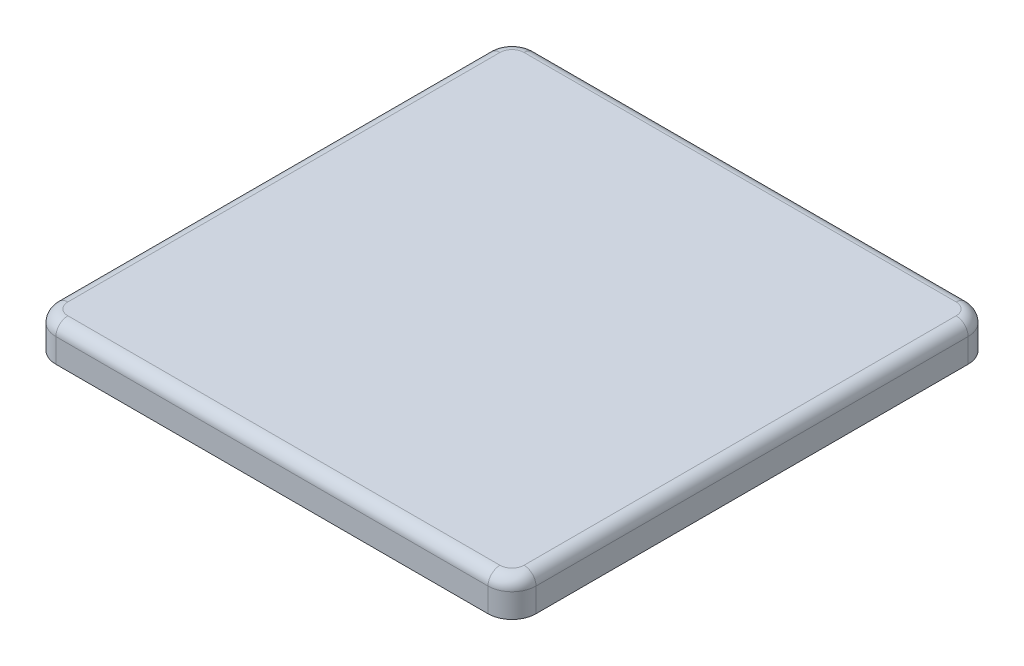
from build123d import *

# Parameters (mm, degrees)
EXTRUDE_1_DEPTH     = 1.5
FILLET_1_R          = 1
CUT_EXTRUDE_2_DEPTH = 1
SKETCH_4_W          = 2.7
SKETCH_4_H          = 4.2
EXTRUDE_4_DEPTH     = 7
FILLET_2_R          = 1


with BuildPart() as part:
    # Sketch 1 → Extrude 1 (new, symmetric)
    with BuildSketch(Plane(origin=(0, 0, 0), x_dir=(0, 0, -1), z_dir=(0, 1, 0))):
        with BuildLine():
            Line((-18, 20), (18, 20))
            ThreePointArc((18, 20), (19.414213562, 19.414213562), (20, 18))
            Line((20, 18), (20, -18))
            ThreePointArc((20, -18), (19.414213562, -19.414213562), (18, -20))
            Line((18, -20), (-18, -20))
            ThreePointArc((-18, -20), (-19.414213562, -19.414213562), (-20, -18))
            Line((-20, -18), (-20, 18))
            ThreePointArc((-20, 18), (-19.414213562, 19.414213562), (-18, 20))
        make_face()
    extrude(amount=EXTRUDE_1_DEPTH, both=True)

    # Fillet 1
    fillet_1_edges = [part.edges().sort_by_distance(p)[0] for p in [
        (-19.414213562, 1.5, 19.414213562),
        (0, 1.5, 20),
        (19.414213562, 1.5, 19.414213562),
        (20, 1.5, 0),
        (19.414213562, 1.5, -19.414213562),
        (0, 1.5, -20),
        (-19.414213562, 1.5, -19.414213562),
        (-20, 1.5, 0),
    ]]
    fillet(fillet_1_edges, radius=FILLET_1_R)

    # Sketch 2 → Cut-Extrude 2 (cut)
    with BuildSketch(Plane.XZ.offset(1.5)):
        with BuildLine():
            Line((-18, 18.8), (18, 18.8))
            ThreePointArc((18, 18.8), (18.565685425, 18.565685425), (18.8, 18))
            Line((18.8, 18), (18.8, -18))
            ThreePointArc((18.8, -18), (18.565685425, -18.565685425), (18, -18.8))
            Line((18, -18.8), (-18, -18.8))
            ThreePointArc((-18, -18.8), (-18.565685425, -18.565685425), (-18.8, -18))
            Line((-18.8, -18), (-18.8, 18))
            ThreePointArc((-18.8, 18), (-18.565685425, 18.565685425), (-18, 18.8))
        make_face()
    extrude(amount=-CUT_EXTRUDE_2_DEPTH, mode=Mode.SUBTRACT)

    # Sketch 4 → Extrude 4 (add)
    with BuildSketch(Plane.XZ.offset(0.5)):
        with Locations((-10, 10)):
            Rectangle(SKETCH_4_W, SKETCH_4_H)
        with Locations((10, 10)):
            Rectangle(SKETCH_4_W, SKETCH_4_H)
        with Locations((-10, -10)):
            Rectangle(SKETCH_4_W, SKETCH_4_H)
        with Locations((10, -10)):
            Rectangle(SKETCH_4_W, SKETCH_4_H)
    extrude(amount=EXTRUDE_4_DEPTH)

    # Fillet 2
    fillet_2_edges = [part.edges().sort_by_distance(p)[0] for p in [
        (8.65, -7.5, -10),
        (10, -7.5, -12.1),
        (11.35, -7.5, -10),
        (10, -7.5, -7.9),
        (-11.35, -7.5, 10),
        (-10, -7.5, 7.9),
        (-8.65, -7.5, 10),
        (-10, -7.5, 12.1),
        (8.65, -7.5, 10),
        (10, -7.5, 7.9),
        (11.35, -7.5, 10),
        (10, -7.5, 12.1),
        (-11.35, -7.5, -10),
        (-10, -7.5, -12.1),
        (-8.65, -7.5, -10),
        (-10, -7.5, -7.9),
    ]]
    fillet(fillet_2_edges, radius=FILLET_2_R)


solid = part.part
